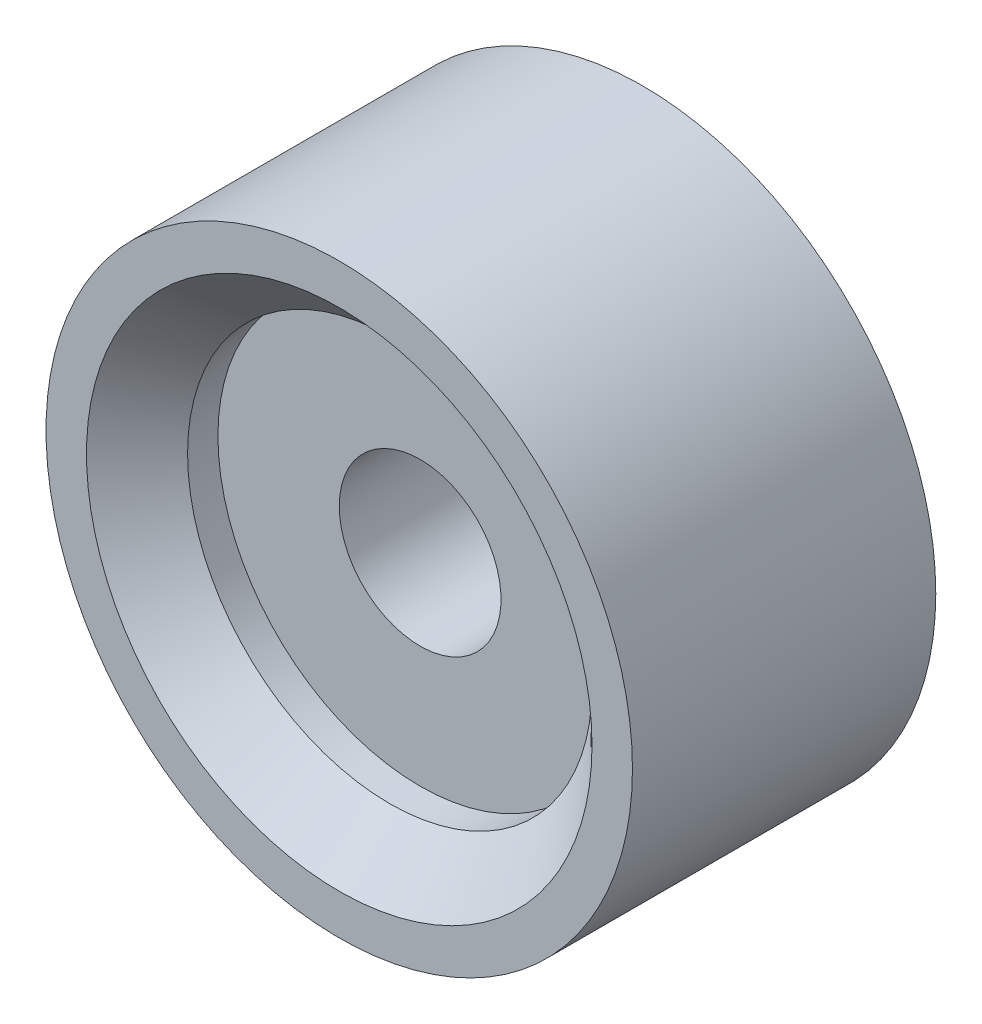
ISO-10303-21;
HEADER;
FILE_DESCRIPTION(('STEP AP214'),'2;1');
FILE_NAME('part.step','',(''),(''),'','','');
FILE_SCHEMA(('AUTOMOTIVE_DESIGN { 1 0 10303 214 1 1 1 1 }'));
ENDSEC;
DATA;
#1=APPLICATION_CONTEXT('core data for automotive mechanical design processes');
#2=APPLICATION_PROTOCOL_DEFINITION('international standard','automotive_design',2000,#1);
#3=PRODUCT_CONTEXT('',#1,'mechanical');
#4=PRODUCT('Part','Part','',(#3));
#5=PRODUCT_RELATED_PRODUCT_CATEGORY('part','',(#4));
#6=PRODUCT_DEFINITION_FORMATION('','',#4);
#7=PRODUCT_DEFINITION_CONTEXT('part definition',#1,'design');
#8=PRODUCT_DEFINITION('design','',#6,#7);
#9=PRODUCT_DEFINITION_SHAPE('','',#8);
#10=(LENGTH_UNIT() NAMED_UNIT(*) SI_UNIT(.MILLI.,.METRE.));
#11=(NAMED_UNIT(*) PLANE_ANGLE_UNIT() SI_UNIT($,.RADIAN.));
#12=(NAMED_UNIT(*) SI_UNIT($,.STERADIAN.) SOLID_ANGLE_UNIT());
#13=UNCERTAINTY_MEASURE_WITH_UNIT(LENGTH_MEASURE(1.E-05),#10,'distance_accuracy_value','');
#14=(GEOMETRIC_REPRESENTATION_CONTEXT(3) GLOBAL_UNCERTAINTY_ASSIGNED_CONTEXT((#13)) GLOBAL_UNIT_ASSIGNED_CONTEXT((#10,
#11,#12)) REPRESENTATION_CONTEXT('',''));
#15=CARTESIAN_POINT('',(0.,0.,0.));
#16=DIRECTION('',(0.,0.,1.));
#17=DIRECTION('',(1.,0.,0.));
#18=AXIS2_PLACEMENT_3D('',#15,#16,#17);
#19=CARTESIAN_POINT('',(0.,0.,7.5));
#20=DIRECTION('',(0.,0.,1.));
#21=DIRECTION('',(1.,0.,0.));
#22=AXIS2_PLACEMENT_3D('',#19,#20,#21);
#23=PLANE('',#22);
#24=CARTESIAN_POINT('',(0.,0.,7.5));
#25=DIRECTION('',(0.,0.,1.));
#26=DIRECTION('',(1.,0.,0.));
#27=AXIS2_PLACEMENT_3D('',#24,#25,#26);
#28=CIRCLE('',#27,12.5);
#29=CARTESIAN_POINT('',(12.5,0.,7.5));
#30=VERTEX_POINT('',#29);
#31=EDGE_CURVE('E19',#30,#30,#28,.T.);
#32=ORIENTED_EDGE('',*,*,#31,.F.);
#33=EDGE_LOOP('',(#32));
#34=FACE_BOUND('',#33,.T.);
#35=CARTESIAN_POINT('',(0.,0.,7.5));
#36=DIRECTION('',(0.,0.,1.));
#37=DIRECTION('',(1.,0.,0.));
#38=AXIS2_PLACEMENT_3D('',#35,#36,#37);
#39=CIRCLE('',#38,14.5);
#40=CARTESIAN_POINT('',(14.5,0.,7.5));
#41=VERTEX_POINT('',#40);
#42=EDGE_CURVE('E45',#41,#41,#39,.T.);
#43=ORIENTED_EDGE('',*,*,#42,.T.);
#44=EDGE_LOOP('',(#43));
#45=FACE_BOUND('',#44,.T.);
#46=ADVANCED_FACE('F12',(#34,#45),#23,.T.);
#47=CARTESIAN_POINT('',(0.,0.,-7.5));
#48=DIRECTION('',(0.,0.,1.));
#49=DIRECTION('',(1.,0.,0.));
#50=AXIS2_PLACEMENT_3D('',#47,#48,#49);
#51=PLANE('',#50);
#52=CARTESIAN_POINT('',(0.,0.,-7.5));
#53=DIRECTION('',(0.,0.,-1.));
#54=DIRECTION('',(-1.,0.,0.));
#55=AXIS2_PLACEMENT_3D('',#52,#53,#54);
#56=CIRCLE('',#55,12.5);
#57=CARTESIAN_POINT('',(-12.5,0.,-7.5));
#58=VERTEX_POINT('',#57);
#59=EDGE_CURVE('E8',#58,#58,#56,.T.);
#60=ORIENTED_EDGE('',*,*,#59,.F.);
#61=EDGE_LOOP('',(#60));
#62=FACE_BOUND('',#61,.T.);
#63=CARTESIAN_POINT('',(0.,0.,-7.5));
#64=DIRECTION('',(0.,0.,1.));
#65=DIRECTION('',(1.,0.,0.));
#66=AXIS2_PLACEMENT_3D('',#63,#64,#65);
#67=CIRCLE('',#66,14.5);
#68=CARTESIAN_POINT('',(14.5,0.,-7.5));
#69=VERTEX_POINT('',#68);
#70=EDGE_CURVE('E44',#69,#69,#67,.T.);
#71=ORIENTED_EDGE('',*,*,#70,.F.);
#72=EDGE_LOOP('',(#71));
#73=FACE_BOUND('',#72,.T.);
#74=ADVANCED_FACE('F54',(#62,#73),#51,.F.);
#75=CARTESIAN_POINT('',(0.,0.,-7.5));
#76=DIRECTION('',(0.,0.,-1.));
#77=DIRECTION('',(-1.,0.,0.));
#78=AXIS2_PLACEMENT_3D('',#75,#76,#77);
#79=CONICAL_SURFACE('',#78,12.5,0.78539816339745);
#80=CARTESIAN_POINT('',(0.,0.,-5.));
#81=DIRECTION('',(0.,0.,-1.));
#82=DIRECTION('',(-1.,0.,0.));
#83=AXIS2_PLACEMENT_3D('',#80,#81,#82);
#84=CIRCLE('',#83,10.);
#85=CARTESIAN_POINT('',(-10.,0.,-5.));
#86=VERTEX_POINT('',#85);
#87=EDGE_CURVE('E24',#86,#86,#84,.T.);
#88=ORIENTED_EDGE('',*,*,#87,.F.);
#89=EDGE_LOOP('',(#88));
#90=FACE_BOUND('',#89,.T.);
#91=ORIENTED_EDGE('',*,*,#59,.T.);
#92=EDGE_LOOP('',(#91));
#93=FACE_BOUND('',#92,.T.);
#94=ADVANCED_FACE('F56',(#90,#93),#79,.F.);
#95=CARTESIAN_POINT('',(0.,0.,7.5));
#96=DIRECTION('',(0.,0.,1.));
#97=DIRECTION('',(1.,0.,0.));
#98=AXIS2_PLACEMENT_3D('',#95,#96,#97);
#99=CONICAL_SURFACE('',#98,12.5,0.78539816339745);
#100=CARTESIAN_POINT('',(0.,0.,5.));
#101=DIRECTION('',(0.,0.,1.));
#102=DIRECTION('',(1.,0.,0.));
#103=AXIS2_PLACEMENT_3D('',#100,#101,#102);
#104=CIRCLE('',#103,10.);
#105=CARTESIAN_POINT('',(10.,0.,5.));
#106=VERTEX_POINT('',#105);
#107=EDGE_CURVE('E34',#106,#106,#104,.T.);
#108=ORIENTED_EDGE('',*,*,#107,.F.);
#109=EDGE_LOOP('',(#108));
#110=FACE_BOUND('',#109,.T.);
#111=ORIENTED_EDGE('',*,*,#31,.T.);
#112=EDGE_LOOP('',(#111));
#113=FACE_BOUND('',#112,.T.);
#114=ADVANCED_FACE('F64',(#110,#113),#99,.F.);
#115=CARTESIAN_POINT('',(0.,0.,7.5));
#116=DIRECTION('',(0.,0.,-1.));
#117=DIRECTION('',(-1.,0.,0.));
#118=AXIS2_PLACEMENT_3D('',#115,#116,#117);
#119=CYLINDRICAL_SURFACE('',#118,4.);
#120=CARTESIAN_POINT('',(0.,0.,3.5));
#121=DIRECTION('',(0.,0.,-1.));
#122=DIRECTION('',(-1.,0.,0.));
#123=AXIS2_PLACEMENT_3D('',#120,#121,#122);
#124=CIRCLE('',#123,4.);
#125=CARTESIAN_POINT('',(-4.,0.,3.5));
#126=VERTEX_POINT('',#125);
#127=EDGE_CURVE('E15',#126,#126,#124,.F.);
#128=ORIENTED_EDGE('',*,*,#127,.T.);
#129=EDGE_LOOP('',(#128));
#130=FACE_BOUND('',#129,.T.);
#131=CARTESIAN_POINT('',(0.,0.,-3.5));
#132=DIRECTION('',(0.,0.,1.));
#133=DIRECTION('',(1.,0.,0.));
#134=AXIS2_PLACEMENT_3D('',#131,#132,#133);
#135=CIRCLE('',#134,4.);
#136=CARTESIAN_POINT('',(4.,0.,-3.5));
#137=VERTEX_POINT('',#136);
#138=EDGE_CURVE('E27',#137,#137,#135,.F.);
#139=ORIENTED_EDGE('',*,*,#138,.T.);
#140=EDGE_LOOP('',(#139));
#141=FACE_BOUND('',#140,.T.);
#142=ADVANCED_FACE('F71',(#130,#141),#119,.F.);
#143=CARTESIAN_POINT('',(0.,0.,-3.5));
#144=DIRECTION('',(0.,0.,1.));
#145=DIRECTION('',(1.,0.,0.));
#146=AXIS2_PLACEMENT_3D('',#143,#144,#145);
#147=PLANE('',#146);
#148=CARTESIAN_POINT('',(0.,0.,-3.5));
#149=DIRECTION('',(0.,0.,-1.));
#150=DIRECTION('',(-1.,0.,0.));
#151=AXIS2_PLACEMENT_3D('',#148,#149,#150);
#152=CIRCLE('',#151,10.);
#153=CARTESIAN_POINT('',(-10.,0.,-3.5));
#154=VERTEX_POINT('',#153);
#155=EDGE_CURVE('E29',#154,#154,#152,.T.);
#156=ORIENTED_EDGE('',*,*,#155,.T.);
#157=EDGE_LOOP('',(#156));
#158=FACE_BOUND('',#157,.T.);
#159=ORIENTED_EDGE('',*,*,#138,.F.);
#160=EDGE_LOOP('',(#159));
#161=FACE_BOUND('',#160,.T.);
#162=ADVANCED_FACE('F75',(#158,#161),#147,.F.);
#163=CARTESIAN_POINT('',(0.,0.,-7.5));
#164=DIRECTION('',(0.,0.,-1.));
#165=DIRECTION('',(-1.,0.,0.));
#166=AXIS2_PLACEMENT_3D('',#163,#164,#165);
#167=CYLINDRICAL_SURFACE('',#166,10.);
#168=ORIENTED_EDGE('',*,*,#87,.T.);
#169=EDGE_LOOP('',(#168));
#170=FACE_BOUND('',#169,.T.);
#171=ORIENTED_EDGE('',*,*,#155,.F.);
#172=EDGE_LOOP('',(#171));
#173=FACE_BOUND('',#172,.T.);
#174=ADVANCED_FACE('F79',(#170,#173),#167,.F.);
#175=CARTESIAN_POINT('',(0.,0.,3.5));
#176=DIRECTION('',(0.,0.,-1.));
#177=DIRECTION('',(-1.,0.,0.));
#178=AXIS2_PLACEMENT_3D('',#175,#176,#177);
#179=PLANE('',#178);
#180=CARTESIAN_POINT('',(0.,0.,3.5));
#181=DIRECTION('',(0.,0.,-1.));
#182=DIRECTION('',(-1.,0.,0.));
#183=AXIS2_PLACEMENT_3D('',#180,#181,#182);
#184=CIRCLE('',#183,10.);
#185=CARTESIAN_POINT('',(-10.,0.,3.5));
#186=VERTEX_POINT('',#185);
#187=EDGE_CURVE('E41',#186,#186,#184,.T.);
#188=ORIENTED_EDGE('',*,*,#187,.F.);
#189=EDGE_LOOP('',(#188));
#190=FACE_BOUND('',#189,.T.);
#191=ORIENTED_EDGE('',*,*,#127,.F.);
#192=EDGE_LOOP('',(#191));
#193=FACE_BOUND('',#192,.T.);
#194=ADVANCED_FACE('F82',(#190,#193),#179,.F.);
#195=CARTESIAN_POINT('',(0.,0.,-7.5));
#196=DIRECTION('',(0.,0.,-1.));
#197=DIRECTION('',(-1.,0.,0.));
#198=AXIS2_PLACEMENT_3D('',#195,#196,#197);
#199=CYLINDRICAL_SURFACE('',#198,10.);
#200=ORIENTED_EDGE('',*,*,#107,.T.);
#201=EDGE_LOOP('',(#200));
#202=FACE_BOUND('',#201,.T.);
#203=ORIENTED_EDGE('',*,*,#187,.T.);
#204=EDGE_LOOP('',(#203));
#205=FACE_BOUND('',#204,.T.);
#206=ADVANCED_FACE('F84',(#202,#205),#199,.F.);
#207=CARTESIAN_POINT('',(0.,0.,-7.5));
#208=DIRECTION('',(0.,0.,1.));
#209=DIRECTION('',(1.,0.,0.));
#210=AXIS2_PLACEMENT_3D('',#207,#208,#209);
#211=CYLINDRICAL_SURFACE('',#210,14.5);
#212=ORIENTED_EDGE('',*,*,#70,.T.);
#213=EDGE_LOOP('',(#212));
#214=FACE_BOUND('',#213,.T.);
#215=ORIENTED_EDGE('',*,*,#42,.F.);
#216=EDGE_LOOP('',(#215));
#217=FACE_BOUND('',#216,.T.);
#218=ADVANCED_FACE('F51',(#214,#217),#211,.T.);
#219=CLOSED_SHELL('',(#46,#74,#94,#114,#142,#162,#174,#194,#206,#218));
#220=MANIFOLD_SOLID_BREP('B1',#219);
#221=ADVANCED_BREP_SHAPE_REPRESENTATION('',(#18,#220),#14);
#222=SHAPE_DEFINITION_REPRESENTATION(#9,#221);
ENDSEC;
END-ISO-10303-21;
